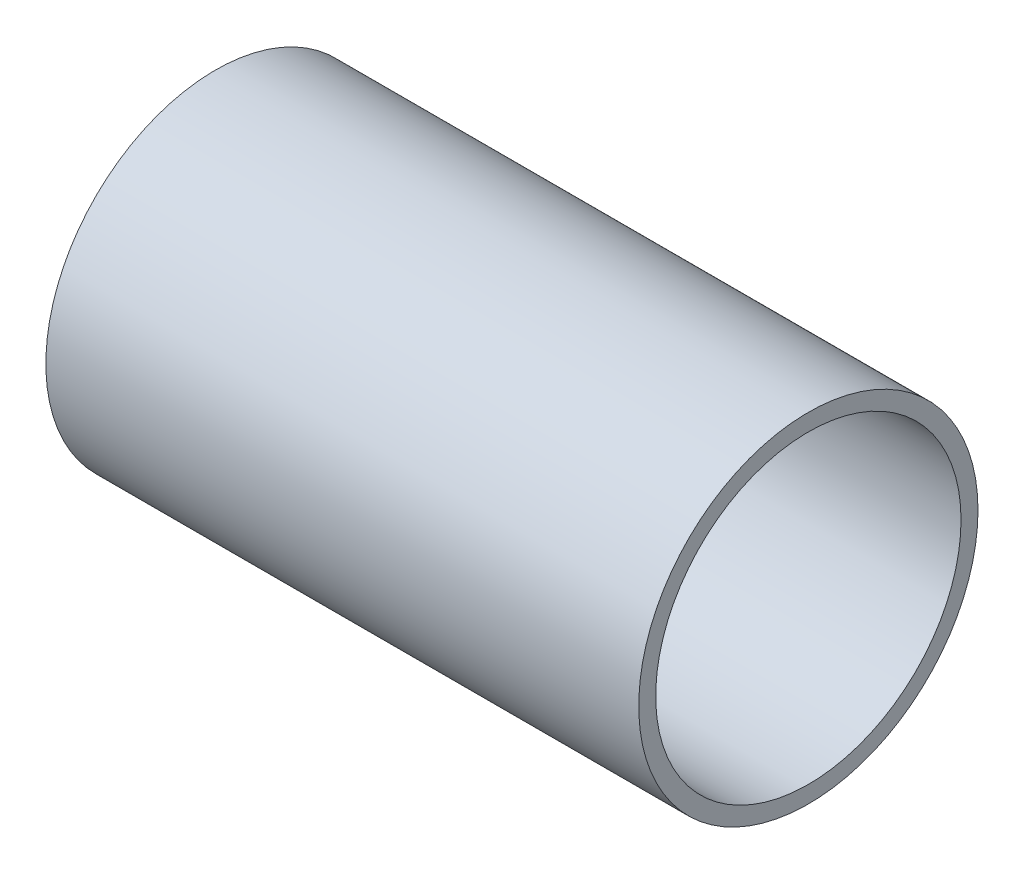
from build123d import *

# Parameters (mm, degrees)
ESQUISSE1_W = 69.9
ESQUISSE1_H = 2


with BuildPart() as part:
    # Esquisse1 → R_volution1 (revolve)
    with BuildSketch(Plane.XY, mode=Mode.PRIVATE) as r_volution1_sk:
        with Locations((0, 19)):
            Rectangle(ESQUISSE1_W, ESQUISSE1_H)
    revolve(r_volution1_sk.sketch.rotate(Axis((-34.95, 0, 0), (1, 0, 0)), 270), axis=Axis((-34.95, 0, 0), (1, 0, 0)))


solid = part.part
